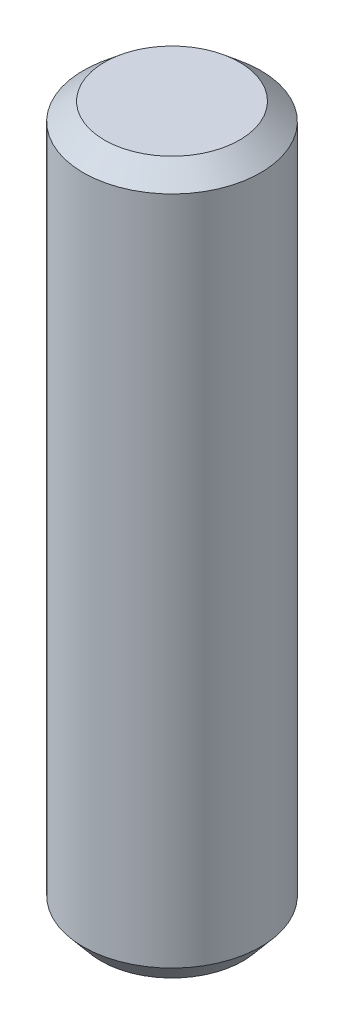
ISO-10303-21;
HEADER;
FILE_DESCRIPTION(('STEP AP214'),'2;1');
FILE_NAME('part.step','',(''),(''),'','','');
FILE_SCHEMA(('AUTOMOTIVE_DESIGN { 1 0 10303 214 1 1 1 1 }'));
ENDSEC;
DATA;
#1=APPLICATION_CONTEXT('core data for automotive mechanical design processes');
#2=APPLICATION_PROTOCOL_DEFINITION('international standard','automotive_design',2000,#1);
#3=PRODUCT_CONTEXT('',#1,'mechanical');
#4=PRODUCT('Part','Part','',(#3));
#5=PRODUCT_RELATED_PRODUCT_CATEGORY('part','',(#4));
#6=PRODUCT_DEFINITION_FORMATION('','',#4);
#7=PRODUCT_DEFINITION_CONTEXT('part definition',#1,'design');
#8=PRODUCT_DEFINITION('design','',#6,#7);
#9=PRODUCT_DEFINITION_SHAPE('','',#8);
#10=(LENGTH_UNIT() NAMED_UNIT(*) SI_UNIT(.MILLI.,.METRE.));
#11=(NAMED_UNIT(*) PLANE_ANGLE_UNIT() SI_UNIT($,.RADIAN.));
#12=(NAMED_UNIT(*) SI_UNIT($,.STERADIAN.) SOLID_ANGLE_UNIT());
#13=UNCERTAINTY_MEASURE_WITH_UNIT(LENGTH_MEASURE(1.E-05),#10,'distance_accuracy_value','');
#14=(GEOMETRIC_REPRESENTATION_CONTEXT(3) GLOBAL_UNCERTAINTY_ASSIGNED_CONTEXT((#13)) GLOBAL_UNIT_ASSIGNED_CONTEXT((#10,
#11,#12)) REPRESENTATION_CONTEXT('',''));
#15=CARTESIAN_POINT('',(0.,0.,0.));
#16=DIRECTION('',(0.,0.,1.));
#17=DIRECTION('',(1.,0.,0.));
#18=AXIS2_PLACEMENT_3D('',#15,#16,#17);
#19=CARTESIAN_POINT('',(0.,20.,0.));
#20=DIRECTION('',(0.,-1.,0.));
#21=DIRECTION('',(0.,0.,-1.));
#22=AXIS2_PLACEMENT_3D('',#19,#20,#21);
#23=CYLINDRICAL_SURFACE('',#22,5.);
#24=CARTESIAN_POINT('',(0.,-18.8082464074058,0.));
#25=DIRECTION('',(0.,1.,0.));
#26=DIRECTION('',(0.,0.,1.));
#27=AXIS2_PLACEMENT_3D('',#24,#25,#26);
#28=CIRCLE('',#27,5.);
#29=CARTESIAN_POINT('',(0.,-18.8082464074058,5.));
#30=VERTEX_POINT('',#29);
#31=EDGE_CURVE('E42',#30,#30,#28,.T.);
#32=ORIENTED_EDGE('',*,*,#31,.T.);
#33=EDGE_LOOP('',(#32));
#34=FACE_BOUND('',#33,.T.);
#35=CARTESIAN_POINT('',(0.,19.,0.));
#36=DIRECTION('',(0.,1.,0.));
#37=DIRECTION('',(0.,0.,1.));
#38=AXIS2_PLACEMENT_3D('',#35,#36,#37);
#39=CIRCLE('',#38,5.);
#40=CARTESIAN_POINT('',(0.,19.,5.));
#41=VERTEX_POINT('',#40);
#42=EDGE_CURVE('E46',#41,#41,#39,.F.);
#43=ORIENTED_EDGE('',*,*,#42,.T.);
#44=EDGE_LOOP('',(#43));
#45=FACE_BOUND('',#44,.T.);
#46=ADVANCED_FACE('F31',(#34,#45),#23,.T.);
#47=CARTESIAN_POINT('',(0.,20.,0.));
#48=DIRECTION('',(0.,1.,0.));
#49=DIRECTION('',(0.,0.,1.));
#50=AXIS2_PLACEMENT_3D('',#47,#48,#49);
#51=PLANE('',#50);
#52=CARTESIAN_POINT('',(0.,20.,0.));
#53=DIRECTION('',(0.,1.,0.));
#54=DIRECTION('',(0.,0.,1.));
#55=AXIS2_PLACEMENT_3D('',#52,#53,#54);
#56=CIRCLE('',#55,3.80824640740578);
#57=CARTESIAN_POINT('',(0.,20.,3.80824640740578));
#58=VERTEX_POINT('',#57);
#59=EDGE_CURVE('E10',#58,#58,#56,.T.);
#60=ORIENTED_EDGE('',*,*,#59,.T.);
#61=EDGE_LOOP('',(#60));
#62=FACE_BOUND('',#61,.T.);
#63=ADVANCED_FACE('F62',(#62),#51,.T.);
#64=CARTESIAN_POINT('',(0.,-20.,0.));
#65=DIRECTION('',(0.,1.,0.));
#66=DIRECTION('',(0.,0.,1.));
#67=AXIS2_PLACEMENT_3D('',#64,#65,#66);
#68=PLANE('',#67);
#69=CARTESIAN_POINT('',(0.,-20.,0.));
#70=DIRECTION('',(0.,1.,0.));
#71=DIRECTION('',(0.,0.,1.));
#72=AXIS2_PLACEMENT_3D('',#69,#70,#71);
#73=CIRCLE('',#72,4.);
#74=CARTESIAN_POINT('',(0.,-20.,4.));
#75=VERTEX_POINT('',#74);
#76=EDGE_CURVE('E38',#75,#75,#73,.F.);
#77=ORIENTED_EDGE('',*,*,#76,.T.);
#78=EDGE_LOOP('',(#77));
#79=FACE_BOUND('',#78,.T.);
#80=ADVANCED_FACE('F59',(#79),#68,.F.);
#81=CARTESIAN_POINT('',(0.,-18.8082464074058,0.));
#82=DIRECTION('',(0.,1.,0.));
#83=DIRECTION('',(0.,0.,1.));
#84=AXIS2_PLACEMENT_3D('',#81,#82,#83);
#85=CONICAL_SURFACE('',#84,5.,0.698131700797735);
#86=ORIENTED_EDGE('',*,*,#76,.F.);
#87=EDGE_LOOP('',(#86));
#88=FACE_BOUND('',#87,.T.);
#89=ORIENTED_EDGE('',*,*,#31,.F.);
#90=EDGE_LOOP('',(#89));
#91=FACE_BOUND('',#90,.T.);
#92=ADVANCED_FACE('F55',(#88,#91),#85,.T.);
#93=CARTESIAN_POINT('',(0.,20.,0.));
#94=DIRECTION('',(0.,-1.,0.));
#95=DIRECTION('',(0.,0.,-1.));
#96=AXIS2_PLACEMENT_3D('',#93,#94,#95);
#97=CONICAL_SURFACE('',#96,3.80824640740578,0.872664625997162);
#98=ORIENTED_EDGE('',*,*,#42,.F.);
#99=EDGE_LOOP('',(#98));
#100=FACE_BOUND('',#99,.T.);
#101=ORIENTED_EDGE('',*,*,#59,.F.);
#102=EDGE_LOOP('',(#101));
#103=FACE_BOUND('',#102,.T.);
#104=ADVANCED_FACE('F33',(#100,#103),#97,.T.);
#105=CLOSED_SHELL('',(#46,#63,#80,#92,#104));
#106=MANIFOLD_SOLID_BREP('B2',#105);
#107=ADVANCED_BREP_SHAPE_REPRESENTATION('',(#18,#106),#14);
#108=SHAPE_DEFINITION_REPRESENTATION(#9,#107);
ENDSEC;
END-ISO-10303-21;
